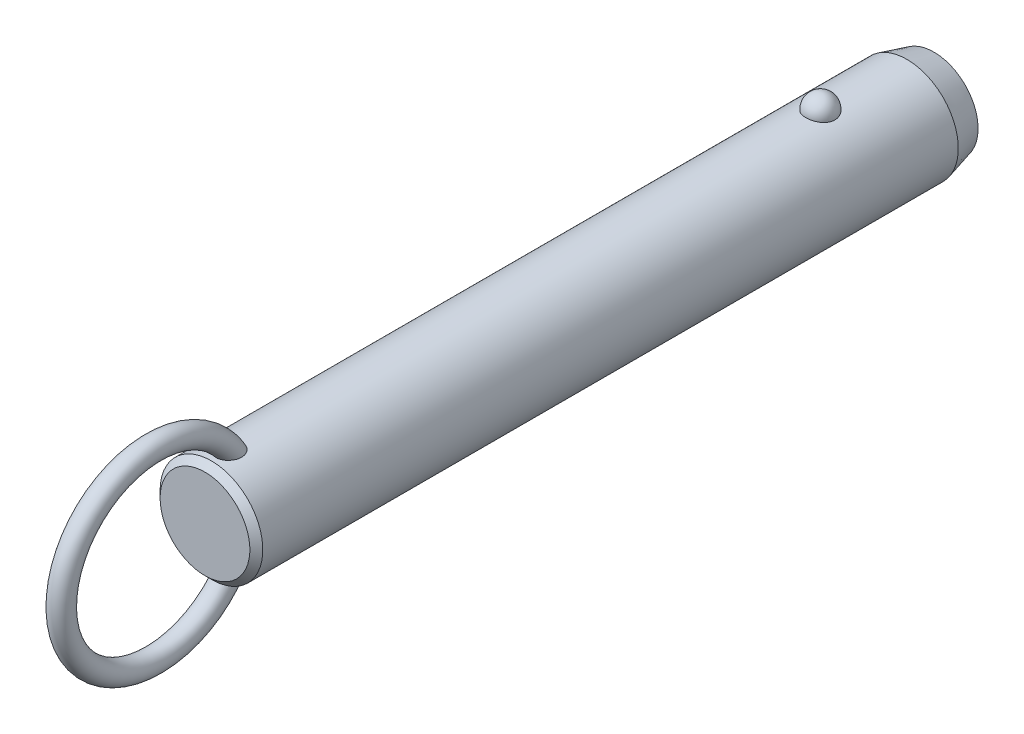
ISO-10303-21;
HEADER;
FILE_DESCRIPTION(('STEP AP214'),'2;1');
FILE_NAME('part.step','',(''),(''),'','','');
FILE_SCHEMA(('AUTOMOTIVE_DESIGN { 1 0 10303 214 1 1 1 1 }'));
ENDSEC;
DATA;
#1=APPLICATION_CONTEXT('core data for automotive mechanical design processes');
#2=APPLICATION_PROTOCOL_DEFINITION('international standard','automotive_design',2000,#1);
#3=PRODUCT_CONTEXT('',#1,'mechanical');
#4=PRODUCT('Part','Part','',(#3));
#5=PRODUCT_RELATED_PRODUCT_CATEGORY('part','',(#4));
#6=PRODUCT_DEFINITION_FORMATION('','',#4);
#7=PRODUCT_DEFINITION_CONTEXT('part definition',#1,'design');
#8=PRODUCT_DEFINITION('design','',#6,#7);
#9=PRODUCT_DEFINITION_SHAPE('','',#8);
#10=(LENGTH_UNIT() NAMED_UNIT(*) SI_UNIT(.MILLI.,.METRE.));
#11=(NAMED_UNIT(*) PLANE_ANGLE_UNIT() SI_UNIT($,.RADIAN.));
#12=(NAMED_UNIT(*) SI_UNIT($,.STERADIAN.) SOLID_ANGLE_UNIT());
#13=UNCERTAINTY_MEASURE_WITH_UNIT(LENGTH_MEASURE(1.E-05),#10,'distance_accuracy_value','');
#14=(GEOMETRIC_REPRESENTATION_CONTEXT(3) GLOBAL_UNCERTAINTY_ASSIGNED_CONTEXT((#13)) GLOBAL_UNIT_ASSIGNED_CONTEXT((#10,
#11,#12)) REPRESENTATION_CONTEXT('',''));
#15=CARTESIAN_POINT('',(0.,0.,0.));
#16=DIRECTION('',(0.,0.,1.));
#17=DIRECTION('',(1.,0.,0.));
#18=AXIS2_PLACEMENT_3D('',#15,#16,#17);
#19=CARTESIAN_POINT('',(0.,0.,101.6));
#20=DIRECTION('',(0.,0.,-1.));
#21=DIRECTION('',(-1.,0.,0.));
#22=AXIS2_PLACEMENT_3D('',#19,#20,#21);
#23=CYLINDRICAL_SURFACE('',#22,9.5);
#24=CARTESIAN_POINT('',(2.67259918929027,9.11631578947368,-2.70000000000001));
#25=CARTESIAN_POINT('',(2.6725968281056,9.11631786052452,-2.54909854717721));
#26=CARTESIAN_POINT('',(2.66030567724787,9.11994722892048,-2.39816735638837));
#27=CARTESIAN_POINT('',(2.6114347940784,9.13405924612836,-2.10058568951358));
#28=CARTESIAN_POINT('',(2.57484658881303,9.14454428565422,-1.95393672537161));
#29=CARTESIAN_POINT('',(2.47830875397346,9.17117631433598,-1.66916069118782));
#30=CARTESIAN_POINT('',(2.41836936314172,9.18732082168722,-1.53102991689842));
#31=CARTESIAN_POINT('',(2.27661331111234,9.22346780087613,-1.26705393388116));
#32=CARTESIAN_POINT('',(2.19479699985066,9.24347021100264,-1.14120852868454));
#33=CARTESIAN_POINT('',(2.01085282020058,9.28522401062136,-0.904632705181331));
#34=CARTESIAN_POINT('',(1.90862396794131,9.30698376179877,-0.793982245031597));
#35=CARTESIAN_POINT('',(1.6867437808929,9.34973971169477,-0.591607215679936));
#36=CARTESIAN_POINT('',(1.56709244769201,9.37073591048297,-0.499882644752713));
#37=CARTESIAN_POINT('',(1.31393976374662,9.40956370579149,-0.338167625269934));
#38=CARTESIAN_POINT('',(1.18048026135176,9.42740444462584,-0.268113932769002));
#39=CARTESIAN_POINT('',(0.903154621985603,9.45799906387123,-0.151390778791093));
#40=CARTESIAN_POINT('',(0.759289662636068,9.47075351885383,-0.104718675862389));
#41=CARTESIAN_POINT('',(0.468074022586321,9.48956256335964,-0.0367633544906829));
#42=CARTESIAN_POINT('',(0.320836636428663,9.49573643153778,-0.0150275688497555));
#43=CARTESIAN_POINT('',(0.0246714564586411,9.50112183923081,0.00396199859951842));
#44=CARTESIAN_POINT('',(-0.124256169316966,9.50033406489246,0.00121819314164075));
#45=CARTESIAN_POINT('',(-0.417264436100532,9.4919475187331,-0.0284441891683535));
#46=CARTESIAN_POINT('',(-0.56138413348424,9.48444885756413,-0.0550074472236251));
#47=CARTESIAN_POINT('',(-0.842986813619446,9.46357853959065,-0.131064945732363));
#48=CARTESIAN_POINT('',(-0.980469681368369,9.450206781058,-0.180559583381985));
#49=CARTESIAN_POINT('',(-1.24585005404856,9.41890822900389,-0.301476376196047));
#50=CARTESIAN_POINT('',(-1.37368611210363,9.40095498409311,-0.373026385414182));
#51=CARTESIAN_POINT('',(-1.61552738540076,9.36242964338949,-0.536025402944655));
#52=CARTESIAN_POINT('',(-1.72953116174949,9.34185727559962,-0.627476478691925));
#53=CARTESIAN_POINT('',(-1.9429225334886,9.29984568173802,-0.829844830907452));
#54=CARTESIAN_POINT('',(-2.04198021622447,9.27839736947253,-0.94110821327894));
#55=CARTESIAN_POINT('',(-2.22026460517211,9.23735994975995,-1.17883414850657));
#56=CARTESIAN_POINT('',(-2.29948985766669,9.21777097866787,-1.30529781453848));
#57=CARTESIAN_POINT('',(-2.43697287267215,9.18238994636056,-1.57158566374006));
#58=CARTESIAN_POINT('',(-2.49497068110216,9.16664569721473,-1.71155057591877));
#59=CARTESIAN_POINT('',(-2.5872073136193,9.14104303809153,-1.99961197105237));
#60=CARTESIAN_POINT('',(-2.62144683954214,9.13118445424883,-2.14770821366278));
#61=CARTESIAN_POINT('',(-2.66521466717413,9.11850622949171,-2.44715424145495));
#62=CARTESIAN_POINT('',(-2.67484831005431,9.11565658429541,-2.59848735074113));
#63=CARTESIAN_POINT('',(-2.66946735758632,9.11723375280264,-2.90067317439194));
#64=CARTESIAN_POINT('',(-2.65445345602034,9.12166036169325,-3.05152590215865));
#65=CARTESIAN_POINT('',(-2.60029711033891,9.13724422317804,-3.34766110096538));
#66=CARTESIAN_POINT('',(-2.56127978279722,9.14836656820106,-3.49296833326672));
#67=CARTESIAN_POINT('',(-2.46018844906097,9.17606676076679,-3.77477535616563));
#68=CARTESIAN_POINT('',(-2.39811349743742,9.1926448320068,-3.9112747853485));
#69=CARTESIAN_POINT('',(-2.25202303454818,9.22952198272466,-4.17244273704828));
#70=CARTESIAN_POINT('',(-2.16788714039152,9.24984129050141,-4.29704106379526));
#71=CARTESIAN_POINT('',(-1.9799408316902,9.29188255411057,-4.53013066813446));
#72=CARTESIAN_POINT('',(-1.87612963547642,9.31360456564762,-4.63862130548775));
#73=CARTESIAN_POINT('',(-1.65105429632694,9.35612959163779,-4.8369029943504));
#74=CARTESIAN_POINT('',(-1.52972405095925,9.37692871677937,-4.92661991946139));
#75=CARTESIAN_POINT('',(-1.27318250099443,9.41518970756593,-5.08429106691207));
#76=CARTESIAN_POINT('',(-1.13797219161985,9.432651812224,-5.15224684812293));
#77=CARTESIAN_POINT('',(-0.859280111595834,9.46208255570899,-5.26371827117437));
#78=CARTESIAN_POINT('',(-0.715925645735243,9.47411833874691,-5.30753421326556));
#79=CARTESIAN_POINT('',(-0.423550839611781,9.4916822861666,-5.37076321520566));
#80=CARTESIAN_POINT('',(-0.2745312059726,9.49721125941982,-5.39017930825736));
#81=CARTESIAN_POINT('',(0.0218446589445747,9.50110860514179,-5.40390587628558));
#82=CARTESIAN_POINT('',(0.16917707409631,9.49961381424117,-5.39869609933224));
#83=CARTESIAN_POINT('',(0.460808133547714,9.48993906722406,-5.36441955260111));
#84=CARTESIAN_POINT('',(0.605106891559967,9.48175936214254,-5.33535367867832));
#85=CARTESIAN_POINT('',(0.886027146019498,9.4596376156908,-5.25435587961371));
#86=CARTESIAN_POINT('',(1.02267710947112,9.44571881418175,-5.20251612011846));
#87=CARTESIAN_POINT('',(1.28523827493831,9.41358993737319,-5.07741549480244));
#88=CARTESIAN_POINT('',(1.41114877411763,9.39537958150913,-5.00415322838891));
#89=CARTESIAN_POINT('',(1.65085227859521,9.3562644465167,-4.83684599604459));
#90=CARTESIAN_POINT('',(1.76442346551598,9.33532178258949,-4.74249218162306));
#91=CARTESIAN_POINT('',(1.97425672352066,9.29321198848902,-4.53620389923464));
#92=CARTESIAN_POINT('',(2.07051582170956,9.27204482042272,-4.42426641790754));
#93=CARTESIAN_POINT('',(2.24490086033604,9.23139221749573,-4.18363183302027));
#94=CARTESIAN_POINT('',(2.32267019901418,9.21194380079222,-4.05466990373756));
#95=CARTESIAN_POINT('',(2.45584092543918,9.1773419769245,-3.78517836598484));
#96=CARTESIAN_POINT('',(2.5112497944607,9.16218713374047,-3.64465264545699));
#97=CARTESIAN_POINT('',(2.59380876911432,9.13913522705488,-3.37104301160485));
#98=CARTESIAN_POINT('',(2.62330266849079,9.13064624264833,-3.23871053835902));
#99=CARTESIAN_POINT('',(2.66269870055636,9.11923566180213,-2.97092664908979));
#100=CARTESIAN_POINT('',(2.67260130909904,9.11631393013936,-2.83547530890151));
#101=CARTESIAN_POINT('',(2.67259918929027,9.11631578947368,-2.70000000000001));
#102=B_SPLINE_CURVE_WITH_KNOTS('',3,(#24,#25,#26,#27,#28,#29,#30,#31,#32,#33,#34,#35,#36,#37,
#38,#39,#40,#41,#42,#43,#44,#45,#46,#47,#48,#49,#50,#51,#52,#53,#54,#55,#56,#57,#58,#59,#60,#61,
#62,#63,#64,#65,#66,#67,#68,#69,#70,#71,#72,#73,#74,#75,#76,#77,#78,#79,#80,#81,#82,#83,#84,#85,
#86,#87,#88,#89,#90,#91,#92,#93,#94,#95,#96,#97,#98,#99,#100,#101),.UNSPECIFIED.,.T.,.F.,(4,2,2,
2,2,2,2,2,2,2,2,2,2,2,2,2,2,2,2,2,2,2,2,2,2,2,2,2,2,2,2,2,2,2,2,2,2,2,4),(0.,0.452217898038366,
0.904593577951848,1.35677112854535,1.80894144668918,2.26340676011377,2.71787203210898,
3.17099820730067,3.62407318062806,4.0687883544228,4.51345969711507,4.95160616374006,
5.38976021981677,5.83050358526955,6.27129275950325,6.72071308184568,7.17016633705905,
7.62495278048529,8.07972578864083,8.53254856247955,8.98535859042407,9.43582813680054,
9.88631615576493,10.3393155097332,10.7923328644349,11.2471065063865,11.7018475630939,
12.150795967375,12.599688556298,13.0398725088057,13.4800399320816,13.9184421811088,
14.3568730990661,14.802202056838,15.2476074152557,15.7010097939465,16.1542603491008,
16.5602594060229,16.966248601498),.UNSPECIFIED.);
#103=CARTESIAN_POINT('',(2.67259918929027,9.11631578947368,-2.70000000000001));
#104=VERTEX_POINT('',#103);
#105=EDGE_CURVE('E41',#104,#104,#102,.T.);
#106=ORIENTED_EDGE('',*,*,#105,.T.);
#107=EDGE_LOOP('',(#106));
#108=FACE_BOUND('',#107,.T.);
#109=CARTESIAN_POINT('',(0.,0.,109.92));
#110=DIRECTION('',(0.,0.,1.));
#111=DIRECTION('',(1.,0.,0.));
#112=AXIS2_PLACEMENT_3D('',#109,#110,#111);
#113=CIRCLE('',#112,9.5);
#114=CARTESIAN_POINT('',(-9.50000000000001,0.,109.92));
#115=VERTEX_POINT('',#114);
#116=EDGE_CURVE('E10',#115,#115,#113,.F.);
#117=ORIENTED_EDGE('',*,*,#116,.T.);
#118=EDGE_LOOP('',(#117));
#119=FACE_BOUND('',#118,.T.);
#120=CARTESIAN_POINT('',(-0.697062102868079,-9.47439269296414,104.267808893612));
#121=CARTESIAN_POINT('',(-0.799579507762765,-9.46685146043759,104.307482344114));
#122=CARTESIAN_POINT('',(-0.898575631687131,-9.45788043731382,104.3559309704));
#123=CARTESIAN_POINT('',(-1.08670047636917,-9.43811593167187,104.468868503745));
#124=CARTESIAN_POINT('',(-1.17583204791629,-9.42732297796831,104.533352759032));
#125=CARTESIAN_POINT('',(-1.34179806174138,-9.40513672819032,104.676209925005));
#126=CARTESIAN_POINT('',(-1.41865133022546,-9.39374438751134,104.754561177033));
#127=CARTESIAN_POINT('',(-1.5586004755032,-9.37154196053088,104.922752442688));
#128=CARTESIAN_POINT('',(-1.62169476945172,-9.3607319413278,105.01259377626));
#129=CARTESIAN_POINT('',(-1.73527695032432,-9.34035749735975,105.204500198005));
#130=CARTESIAN_POINT('',(-1.7852226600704,-9.33085270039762,105.306891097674));
#131=CARTESIAN_POINT('',(-1.86924997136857,-9.3143834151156,105.518148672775));
#132=CARTESIAN_POINT('',(-1.90332570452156,-9.30741986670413,105.627017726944));
#133=CARTESIAN_POINT('',(-1.95893603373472,-9.29588482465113,105.860473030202));
#134=CARTESIAN_POINT('',(-1.97872420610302,-9.29165182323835,105.985489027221));
#135=CARTESIAN_POINT('',(-2.00062129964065,-9.28695978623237,106.237080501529));
#136=CARTESIAN_POINT('',(-2.00272284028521,-9.28650232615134,106.363656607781));
#137=CARTESIAN_POINT('',(-1.98958876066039,-9.28932750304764,106.636815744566));
#138=CARTESIAN_POINT('',(-1.97143366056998,-9.2932400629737,106.783251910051));
#139=CARTESIAN_POINT('',(-1.91479925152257,-9.30507151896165,107.072062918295));
#140=CARTESIAN_POINT('',(-1.87629122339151,-9.31299607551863,107.214431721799));
#141=CARTESIAN_POINT('',(-1.77225683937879,-9.33340232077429,107.515172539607));
#142=CARTESIAN_POINT('',(-1.70334898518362,-9.34641636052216,107.672369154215));
#143=CARTESIAN_POINT('',(-1.58111062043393,-9.36759153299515,107.897517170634));
#144=CARTESIAN_POINT('',(-1.53721459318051,-9.37492619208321,107.970796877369));
#145=CARTESIAN_POINT('',(-1.44302631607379,-9.38988566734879,108.11307405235));
#146=CARTESIAN_POINT('',(-1.39273721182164,-9.39751033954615,108.182073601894));
#147=CARTESIAN_POINT('',(-1.26775962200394,-9.41530678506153,108.336983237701));
#148=CARTESIAN_POINT('',(-1.19052326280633,-9.42548108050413,108.420871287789));
#149=CARTESIAN_POINT('',(-1.02420241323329,-9.44499825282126,108.576008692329));
#150=CARTESIAN_POINT('',(-0.935139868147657,-9.45434261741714,108.647280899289));
#151=CARTESIAN_POINT('',(-0.766610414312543,-9.46930670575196,108.758695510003));
#152=CARTESIAN_POINT('',(-0.689439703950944,-9.47529223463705,108.802235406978));
#153=CARTESIAN_POINT('',(-0.528942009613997,-9.48560294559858,108.87631336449));
#154=CARTESIAN_POINT('',(-0.445620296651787,-9.48992953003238,108.906862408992));
#155=CARTESIAN_POINT('',(-0.273901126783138,-9.49644161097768,108.952579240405));
#156=CARTESIAN_POINT('',(-0.185465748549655,-9.49860811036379,108.96761059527));
#157=CARTESIAN_POINT('',(-0.00734541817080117,-9.5004135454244,108.980149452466));
#158=CARTESIAN_POINT('',(0.0823387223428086,-9.50005405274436,108.977667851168));
#159=CARTESIAN_POINT('',(0.247679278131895,-9.49708301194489,108.956995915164));
#160=CARTESIAN_POINT('',(0.323620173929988,-9.49477609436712,108.940930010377));
#161=CARTESIAN_POINT('',(0.471981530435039,-9.48855917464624,108.897172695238));
#162=CARTESIAN_POINT('',(0.544400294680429,-9.48464840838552,108.869475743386));
#163=CARTESIAN_POINT('',(0.70894789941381,-9.47398336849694,108.79280266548));
#164=CARTESIAN_POINT('',(0.799149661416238,-9.46671310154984,108.739774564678));
#165=CARTESIAN_POINT('',(0.969783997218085,-9.45076225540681,108.619973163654));
#166=CARTESIAN_POINT('',(1.05019415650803,-9.44207854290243,108.553169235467));
#167=CARTESIAN_POINT('',(1.23092343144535,-9.42051459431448,108.380759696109));
#168=CARTESIAN_POINT('',(1.3265249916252,-9.40733378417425,108.27026193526));
#169=CARTESIAN_POINT('',(1.49893121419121,-9.38140745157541,108.035561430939));
#170=CARTESIAN_POINT('',(1.57571616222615,-9.36866239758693,107.911344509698));
#171=CARTESIAN_POINT('',(1.71285426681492,-9.34457644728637,107.649389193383));
#172=CARTESIAN_POINT('',(1.77266365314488,-9.33328726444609,107.51136233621));
#173=CARTESIAN_POINT('',(1.87239208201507,-9.31379209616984,107.228051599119));
#174=CARTESIAN_POINT('',(1.9123015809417,-9.3055875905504,107.082764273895));
#175=CARTESIAN_POINT('',(1.97604189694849,-9.29228394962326,106.762028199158));
#176=CARTESIAN_POINT('',(1.99587438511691,-9.28797202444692,106.585724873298));
#177=CARTESIAN_POINT('',(2.0029570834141,-9.28645519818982,106.232414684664));
#178=CARTESIAN_POINT('',(1.99025930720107,-9.28923895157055,106.055409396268));
#179=CARTESIAN_POINT('',(1.93735479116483,-9.30038134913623,105.756338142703));
#180=CARTESIAN_POINT('',(1.90576827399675,-9.30697680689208,105.632667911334));
#181=CARTESIAN_POINT('',(1.82287484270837,-9.32356855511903,105.392329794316));
#182=CARTESIAN_POINT('',(1.77158213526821,-9.33356239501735,105.275656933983));
#183=CARTESIAN_POINT('',(1.64885744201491,-9.35602275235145,105.052706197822));
#184=CARTESIAN_POINT('',(1.57730995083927,-9.36850332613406,104.946492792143));
#185=CARTESIAN_POINT('',(1.4154326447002,-9.39431873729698,104.749553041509));
#186=CARTESIAN_POINT('',(1.32510883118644,-9.40765330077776,104.658821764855));
#187=CARTESIAN_POINT('',(1.13846223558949,-9.43195720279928,104.505033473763));
#188=CARTESIAN_POINT('',(1.04369890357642,-9.44302894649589,104.440094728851));
#189=CARTESIAN_POINT('',(0.843965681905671,-9.46296805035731,104.328038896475));
#190=CARTESIAN_POINT('',(0.739000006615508,-9.47183631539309,104.280914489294));
#191=CARTESIAN_POINT('',(0.528175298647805,-9.48586140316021,104.208117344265));
#192=CARTESIAN_POINT('',(0.422686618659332,-9.49119633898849,104.18140249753));
#193=CARTESIAN_POINT('',(0.208590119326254,-9.49831365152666,104.146013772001));
#194=CARTESIAN_POINT('',(0.0999817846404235,-9.500095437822,104.137342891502));
#195=CARTESIAN_POINT('',(-0.126104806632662,-9.49988861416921,104.138350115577));
#196=CARTESIAN_POINT('',(-0.24357872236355,-9.49757821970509,104.149594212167));
#197=CARTESIAN_POINT('',(-0.474390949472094,-9.48885165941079,104.193167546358));
#198=CARTESIAN_POINT('',(-0.587729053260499,-9.48243528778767,104.225497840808));
#199=CARTESIAN_POINT('',(-0.697062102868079,-9.47439269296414,104.267808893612));
#200=B_SPLINE_CURVE_WITH_KNOTS('',3,(#120,#121,#122,#123,#124,#125,#126,#127,#128,#129,#130,
#131,#132,#133,#134,#135,#136,#137,#138,#139,#140,#141,#142,#143,#144,#145,#146,#147,#148,#149,
#150,#151,#152,#153,#154,#155,#156,#157,#158,#159,#160,#161,#162,#163,#164,#165,#166,#167,#168,
#169,#170,#171,#172,#173,#174,#175,#176,#177,#178,#179,#180,#181,#182,#183,#184,#185,#186,#187,
#188,#189,#190,#191,#192,#193,#194,#195,#196,#197,#198,#199),.UNSPECIFIED.,.T.,.F.,(4,2,2,2,2,2,
2,2,2,2,2,2,2,2,2,2,2,2,2,2,2,2,2,2,2,2,2,2,2,2,2,2,2,2,2,2,2,2,2,4),(0.,0.330119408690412,
0.660143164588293,0.989655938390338,1.31920659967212,1.66074728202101,2.00241415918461,
2.38088696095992,2.7595176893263,3.20065679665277,3.6424200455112,4.15620996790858,
4.4131416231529,4.66994734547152,5.01228664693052,5.35399933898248,5.61943037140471,
5.88463652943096,6.15215502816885,6.41950709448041,6.65144391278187,6.88349136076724,
7.19641200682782,7.51003602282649,7.94779711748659,8.38601491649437,8.83699707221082,
9.28819530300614,9.81778662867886,10.3465317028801,10.7284172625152,11.110028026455,
11.4938603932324,11.8775702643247,12.2220189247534,12.5663259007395,12.8915939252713,
13.2169159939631,13.5689650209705,13.9210316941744),.UNSPECIFIED.);
#201=CARTESIAN_POINT('',(-0.697062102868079,-9.47439269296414,104.267808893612));
#202=VERTEX_POINT('',#201);
#203=EDGE_CURVE('E59',#202,#202,#200,.T.);
#204=ORIENTED_EDGE('',*,*,#203,.T.);
#205=EDGE_LOOP('',(#204));
#206=FACE_BOUND('',#205,.T.);
#207=CARTESIAN_POINT('',(-0.697062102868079,9.47439269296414,104.267808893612));
#208=CARTESIAN_POINT('',(-0.59779262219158,9.48169483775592,104.22939564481));
#209=CARTESIAN_POINT('',(-0.495106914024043,9.48766580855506,104.199168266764));
#210=CARTESIAN_POINT('',(-0.285876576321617,9.49627648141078,104.156032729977));
#211=CARTESIAN_POINT('',(-0.179324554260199,9.49890941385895,104.143159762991));
#212=CARTESIAN_POINT('',(0.0344157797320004,9.50053798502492,104.135166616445));
#213=CARTESIAN_POINT('',(0.141603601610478,9.49953613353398,104.140034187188));
#214=CARTESIAN_POINT('',(0.353563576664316,9.49401038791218,104.167365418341));
#215=CARTESIAN_POINT('',(0.458336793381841,9.48948807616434,104.18982117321));
#216=CARTESIAN_POINT('',(0.662493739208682,9.4774236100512,104.251671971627));
#217=CARTESIAN_POINT('',(0.761881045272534,9.46988348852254,104.291055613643));
#218=CARTESIAN_POINT('',(0.952608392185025,9.45260382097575,104.385634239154));
#219=CARTESIAN_POINT('',(1.04394806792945,9.44286417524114,104.440829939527));
#220=CARTESIAN_POINT('',(1.21712767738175,9.42211760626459,104.566066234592));
#221=CARTESIAN_POINT('',(1.29885671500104,9.41109835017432,104.636257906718));
#222=CARTESIAN_POINT('',(1.44978975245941,9.38903310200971,104.788980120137));
#223=CARTESIAN_POINT('',(1.51899278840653,9.37798710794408,104.871511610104));
#224=CARTESIAN_POINT('',(1.64602857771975,9.35654375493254,105.049776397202));
#225=CARTESIAN_POINT('',(1.70333052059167,9.34618688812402,105.145891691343));
#226=CARTESIAN_POINT('',(1.80259341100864,9.32755128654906,105.345897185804));
#227=CARTESIAN_POINT('',(1.84454942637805,9.31927322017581,105.449789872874));
#228=CARTESIAN_POINT('',(1.91637039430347,9.30478365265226,105.672213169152));
#229=CARTESIAN_POINT('',(1.944805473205,9.29882552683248,105.791219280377));
#230=CARTESIAN_POINT('',(1.98449865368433,9.29043398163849,106.032143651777));
#231=CARTESIAN_POINT('',(1.99574908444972,9.28800213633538,106.154063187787));
#232=CARTESIAN_POINT('',(2.00275141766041,9.28649645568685,106.416932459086));
#233=CARTESIAN_POINT('',(1.99588238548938,9.28799035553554,106.557952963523));
#234=CARTESIAN_POINT('',(1.96270559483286,9.29505517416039,106.837621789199));
#235=CARTESIAN_POINT('',(1.93637872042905,9.30063010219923,106.976267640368));
#236=CARTESIAN_POINT('',(1.85949176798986,9.31633564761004,107.272561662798));
#237=CARTESIAN_POINT('',(1.80549792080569,9.3270926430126,107.429290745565));
#238=CARTESIAN_POINT('',(1.67376869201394,9.3516306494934,107.732284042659));
#239=CARTESIAN_POINT('',(1.59603181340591,9.36541185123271,107.878547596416));
#240=CARTESIAN_POINT('',(1.4360277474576,9.39110706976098,108.125813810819));
#241=CARTESIAN_POINT('',(1.35831795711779,9.40278656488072,108.229791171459));
#242=CARTESIAN_POINT('',(1.18774483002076,9.42585025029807,108.424534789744));
#243=CARTESIAN_POINT('',(1.09490932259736,9.43723493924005,108.515324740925));
#244=CARTESIAN_POINT('',(0.921110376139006,9.45552616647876,108.65620334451));
#245=CARTESIAN_POINT('',(0.843738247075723,9.46281058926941,108.710656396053));
#246=CARTESIAN_POINT('',(0.681245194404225,9.47589120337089,108.806711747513));
#247=CARTESIAN_POINT('',(0.596135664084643,9.48168953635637,108.848332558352));
#248=CARTESIAN_POINT('',(0.433779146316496,9.49038144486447,108.910089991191));
#249=CARTESIAN_POINT('',(0.357459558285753,9.49359170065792,108.93260136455));
#250=CARTESIAN_POINT('',(0.202074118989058,9.49816761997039,108.964574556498));
#251=CARTESIAN_POINT('',(0.123010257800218,9.49953459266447,108.974045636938));
#252=CARTESIAN_POINT('',(-0.0357372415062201,9.50026497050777,108.979114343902));
#253=CARTESIAN_POINT('',(-0.115421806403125,9.49962433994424,108.974684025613));
#254=CARTESIAN_POINT('',(-0.272823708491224,9.49640854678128,108.952296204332));
#255=CARTESIAN_POINT('',(-0.350540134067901,9.4938325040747,108.934332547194));
#256=CARTESIAN_POINT('',(-0.500580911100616,9.4870946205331,108.886802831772));
#257=CARTESIAN_POINT('',(-0.57297929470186,9.48296359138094,108.857461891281));
#258=CARTESIAN_POINT('',(-0.712864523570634,9.47347609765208,108.789008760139));
#259=CARTESIAN_POINT('',(-0.780349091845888,9.46811906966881,108.749892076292));
#260=CARTESIAN_POINT('',(-0.94630921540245,9.45329720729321,108.639432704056));
#261=CARTESIAN_POINT('',(-1.04090230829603,9.44321512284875,108.562329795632));
#262=CARTESIAN_POINT('',(-1.21661929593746,9.42219227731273,108.39409718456));
#263=CARTESIAN_POINT('',(-1.2977051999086,9.41124921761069,108.302929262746));
#264=CARTESIAN_POINT('',(-1.47319646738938,9.38563439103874,108.076162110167));
#265=CARTESIAN_POINT('',(-1.56208878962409,9.37102009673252,107.936289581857));
#266=CARTESIAN_POINT('',(-1.71623987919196,9.34401559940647,107.643950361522));
#267=CARTESIAN_POINT('',(-1.78147866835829,9.33162728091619,107.491473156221));
#268=CARTESIAN_POINT('',(-1.88853837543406,9.31055541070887,107.175647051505));
#269=CARTESIAN_POINT('',(-1.92998995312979,9.30193076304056,107.012168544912));
#270=CARTESIAN_POINT('',(-1.98590726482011,9.29015757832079,106.680526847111));
#271=CARTESIAN_POINT('',(-2.0004070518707,9.2870021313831,106.512369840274));
#272=CARTESIAN_POINT('',(-1.99964701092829,9.28716218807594,106.205080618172));
#273=CARTESIAN_POINT('',(-1.98908145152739,9.28945704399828,106.065936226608));
#274=CARTESIAN_POINT('',(-1.94566294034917,9.29865169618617,105.791153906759));
#275=CARTESIAN_POINT('',(-1.91282062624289,9.30554929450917,105.655514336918));
#276=CARTESIAN_POINT('',(-1.84582133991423,9.31898248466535,105.457802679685));
#277=CARTESIAN_POINT('',(-1.82038084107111,9.32400364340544,105.392583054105));
#278=CARTESIAN_POINT('',(-1.76350511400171,9.33492884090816,105.264903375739));
#279=CARTESIAN_POINT('',(-1.73207305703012,9.34083241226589,105.202441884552));
#280=CARTESIAN_POINT('',(-1.6632424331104,9.353333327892,105.08094078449));
#281=CARTESIAN_POINT('',(-1.62584239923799,9.35993084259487,105.021902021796));
#282=CARTESIAN_POINT('',(-1.54527678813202,9.37356864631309,104.907987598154));
#283=CARTESIAN_POINT('',(-1.50211241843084,9.38060884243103,104.853111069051));
#284=CARTESIAN_POINT('',(-1.37681147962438,9.40004442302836,104.709961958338));
#285=CARTESIAN_POINT('',(-1.28916358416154,9.41261047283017,104.626429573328));
#286=CARTESIAN_POINT('',(-1.09996826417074,9.43658180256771,104.477236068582));
#287=CARTESIAN_POINT('',(-0.998461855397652,9.44799034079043,104.411523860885));
#288=CARTESIAN_POINT('',(-0.860188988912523,9.46103017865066,104.3394367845));
#289=CARTESIAN_POINT('',(-0.828141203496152,9.46389141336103,104.323851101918));
#290=CARTESIAN_POINT('',(-0.763210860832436,9.46934915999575,104.294473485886));
#291=CARTESIAN_POINT('',(-0.730328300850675,9.47194567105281,104.280681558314));
#292=CARTESIAN_POINT('',(-0.697062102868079,9.47439269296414,104.267808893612));
#293=B_SPLINE_CURVE_WITH_KNOTS('',3,(#207,#208,#209,#210,#211,#212,#213,#214,#215,#216,#217,
#218,#219,#220,#221,#222,#223,#224,#225,#226,#227,#228,#229,#230,#231,#232,#233,#234,#235,#236,
#237,#238,#239,#240,#241,#242,#243,#244,#245,#246,#247,#248,#249,#250,#251,#252,#253,#254,#255,
#256,#257,#258,#259,#260,#261,#262,#263,#264,#265,#266,#267,#268,#269,#270,#271,#272,#273,#274,
#275,#276,#277,#278,#279,#280,#281,#282,#283,#284,#285,#286,#287,#288,#289,#290,#291,#292),
.UNSPECIFIED.,.T.,.F.,(4,2,2,2,2,2,2,2,2,2,2,2,2,2,2,2,2,2,2,2,2,2,2,2,2,2,2,2,2,2,2,2,2,2,2,2,
2,2,2,2,2,2,4),(0.,0.319942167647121,0.640532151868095,0.960900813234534,1.28112555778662,
1.60113495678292,1.92115886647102,2.24457323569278,2.56801248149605,2.90371927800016,
3.23953387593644,3.60560313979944,3.97183576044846,4.39383693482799,4.81625324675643,
5.31257045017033,5.80891895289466,6.19868344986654,6.58773876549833,6.87145417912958,
7.15475838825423,7.3926375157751,7.63034760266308,7.86853584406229,8.10683246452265,
8.3406366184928,8.57454843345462,8.93983939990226,9.30614105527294,9.8026666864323,
10.2996107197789,10.8040753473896,11.3079021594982,11.7249776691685,12.1418541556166,
12.3521485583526,12.562331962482,12.7725671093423,12.9827582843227,13.345827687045,
13.7078449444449,13.8150604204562,13.9222762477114),.UNSPECIFIED.);
#294=CARTESIAN_POINT('',(-0.697062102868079,9.47439269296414,104.267808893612));
#295=VERTEX_POINT('',#294);
#296=EDGE_CURVE('E67',#295,#295,#293,.T.);
#297=ORIENTED_EDGE('',*,*,#296,.T.);
#298=EDGE_LOOP('',(#297));
#299=FACE_BOUND('',#298,.T.);
#300=CARTESIAN_POINT('',(0.,0.,-18.6999999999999));
#301=DIRECTION('',(0.,0.,-1.));
#302=DIRECTION('',(-1.,0.,0.));
#303=AXIS2_PLACEMENT_3D('',#300,#301,#302);
#304=CIRCLE('',#303,9.5);
#305=CARTESIAN_POINT('',(-9.5,0.,-18.6999999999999));
#306=VERTEX_POINT('',#305);
#307=EDGE_CURVE('E56',#306,#306,#304,.F.);
#308=ORIENTED_EDGE('',*,*,#307,.T.);
#309=EDGE_LOOP('',(#308));
#310=FACE_BOUND('',#309,.T.);
#311=ADVANCED_FACE('F37',(#108,#119,#206,#299,#310),#23,.T.);
#312=CARTESIAN_POINT('',(0.,0.,-23.7));
#313=DIRECTION('',(0.,0.,-1.));
#314=DIRECTION('',(-1.,0.,0.));
#315=AXIS2_PLACEMENT_3D('',#312,#313,#314);
#316=PLANE('',#315);
#317=CARTESIAN_POINT('',(0.,0.,-23.7));
#318=DIRECTION('',(0.,0.,-1.));
#319=DIRECTION('',(-1.,0.,0.));
#320=AXIS2_PLACEMENT_3D('',#317,#318,#319);
#321=CIRCLE('',#320,8.16025403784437);
#322=CARTESIAN_POINT('',(-8.16025403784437,0.,-23.7));
#323=VERTEX_POINT('',#322);
#324=EDGE_CURVE('E66',#323,#323,#321,.T.);
#325=ORIENTED_EDGE('',*,*,#324,.T.);
#326=EDGE_LOOP('',(#325));
#327=FACE_BOUND('',#326,.T.);
#328=ADVANCED_FACE('F85',(#327),#316,.T.);
#329=CARTESIAN_POINT('',(0.,0.,-23.7));
#330=DIRECTION('',(0.,0.,1.));
#331=DIRECTION('',(1.,0.,0.));
#332=AXIS2_PLACEMENT_3D('',#329,#330,#331);
#333=CONICAL_SURFACE('',#332,8.16025403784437,0.261799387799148);
#334=ORIENTED_EDGE('',*,*,#307,.F.);
#335=EDGE_LOOP('',(#334));
#336=FACE_BOUND('',#335,.T.);
#337=ORIENTED_EDGE('',*,*,#324,.F.);
#338=EDGE_LOOP('',(#337));
#339=FACE_BOUND('',#338,.T.);
#340=ADVANCED_FACE('F83',(#336,#339),#333,.T.);
#341=CARTESIAN_POINT('',(0.,0.,111.12));
#342=DIRECTION('',(0.,0.,1.));
#343=DIRECTION('',(1.,0.,0.));
#344=AXIS2_PLACEMENT_3D('',#341,#342,#343);
#345=PLANE('',#344);
#346=CARTESIAN_POINT('',(0.,0.,111.12));
#347=DIRECTION('',(0.,0.,1.));
#348=DIRECTION('',(1.,0.,0.));
#349=AXIS2_PLACEMENT_3D('',#346,#347,#348);
#350=CIRCLE('',#349,8.29999999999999);
#351=CARTESIAN_POINT('',(-8.3,0.,111.12));
#352=VERTEX_POINT('',#351);
#353=EDGE_CURVE('E50',#352,#352,#350,.T.);
#354=ORIENTED_EDGE('',*,*,#353,.T.);
#355=EDGE_LOOP('',(#354));
#356=FACE_BOUND('',#355,.T.);
#357=ADVANCED_FACE('F77',(#356),#345,.T.);
#358=CARTESIAN_POINT('',(0.,0.,120.65));
#359=DIRECTION('',(1.,0.,0.));
#360=DIRECTION('',(0.,0.,-1.));
#361=AXIS2_PLACEMENT_3D('',#358,#359,#360);
#362=TOROIDAL_SURFACE('',#361,17.05,2.);
#363=ORIENTED_EDGE('',*,*,#296,.F.);
#364=EDGE_LOOP('',(#363));
#365=FACE_BOUND('',#364,.T.);
#366=ORIENTED_EDGE('',*,*,#203,.F.);
#367=EDGE_LOOP('',(#366));
#368=FACE_BOUND('',#367,.T.);
#369=ADVANCED_FACE('F73',(#365,#368),#362,.T.);
#370=CARTESIAN_POINT('',(0.,0.,111.12));
#371=DIRECTION('',(0.,0.,-1.));
#372=DIRECTION('',(-1.,0.,0.));
#373=AXIS2_PLACEMENT_3D('',#370,#371,#372);
#374=CONICAL_SURFACE('',#373,8.29999999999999,0.785398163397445);
#375=CARTESIAN_POINT('',(-9.50000000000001,0.,109.92));
#376=CARTESIAN_POINT('',(-9.48750000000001,0.,109.9325));
#377=CARTESIAN_POINT('',(-9.47500000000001,0.,109.945));
#378=CARTESIAN_POINT('',(-9.45,0.,109.97));
#379=CARTESIAN_POINT('',(-9.43750000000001,0.,109.9825));
#380=CARTESIAN_POINT('',(-9.41250000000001,0.,110.0075));
#381=CARTESIAN_POINT('',(-9.40000000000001,0.,110.02));
#382=CARTESIAN_POINT('',(-9.37500000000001,0.,110.045));
#383=CARTESIAN_POINT('',(-9.36250000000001,0.,110.0575));
#384=CARTESIAN_POINT('',(-9.33750000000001,0.,110.0825));
#385=CARTESIAN_POINT('',(-9.325,0.,110.095));
#386=CARTESIAN_POINT('',(-9.3,0.,110.12));
#387=CARTESIAN_POINT('',(-9.2875,0.,110.1325));
#388=CARTESIAN_POINT('',(-9.2625,0.,110.1575));
#389=CARTESIAN_POINT('',(-9.25000000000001,0.,110.17));
#390=CARTESIAN_POINT('',(-9.225,0.,110.195));
#391=CARTESIAN_POINT('',(-9.2125,0.,110.2075));
#392=CARTESIAN_POINT('',(-9.1875,0.,110.2325));
#393=CARTESIAN_POINT('',(-9.175,0.,110.245));
#394=CARTESIAN_POINT('',(-9.15000000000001,0.,110.27));
#395=CARTESIAN_POINT('',(-9.1375,0.,110.2825));
#396=CARTESIAN_POINT('',(-9.1125,0.,110.3075));
#397=CARTESIAN_POINT('',(-9.1,0.,110.32));
#398=CARTESIAN_POINT('',(-9.075,0.,110.345));
#399=CARTESIAN_POINT('',(-9.0625,0.,110.3575));
#400=CARTESIAN_POINT('',(-9.0375,0.,110.3825));
#401=CARTESIAN_POINT('',(-9.025,0.,110.395));
#402=CARTESIAN_POINT('',(-9.,0.,110.42));
#403=CARTESIAN_POINT('',(-8.9875,0.,110.4325));
#404=CARTESIAN_POINT('',(-8.9625,0.,110.4575));
#405=CARTESIAN_POINT('',(-8.95,0.,110.47));
#406=CARTESIAN_POINT('',(-8.925,0.,110.495));
#407=CARTESIAN_POINT('',(-8.9125,0.,110.5075));
#408=CARTESIAN_POINT('',(-8.8875,0.,110.5325));
#409=CARTESIAN_POINT('',(-8.875,0.,110.545));
#410=CARTESIAN_POINT('',(-8.85,0.,110.57));
#411=CARTESIAN_POINT('',(-8.8375,0.,110.5825));
#412=CARTESIAN_POINT('',(-8.8125,0.,110.6075));
#413=CARTESIAN_POINT('',(-8.8,0.,110.62));
#414=CARTESIAN_POINT('',(-8.775,0.,110.645));
#415=CARTESIAN_POINT('',(-8.7625,0.,110.6575));
#416=CARTESIAN_POINT('',(-8.7375,0.,110.6825));
#417=CARTESIAN_POINT('',(-8.725,0.,110.695));
#418=CARTESIAN_POINT('',(-8.7,0.,110.72));
#419=CARTESIAN_POINT('',(-8.6875,0.,110.7325));
#420=CARTESIAN_POINT('',(-8.6625,0.,110.7575));
#421=CARTESIAN_POINT('',(-8.65,0.,110.77));
#422=CARTESIAN_POINT('',(-8.625,0.,110.795));
#423=CARTESIAN_POINT('',(-8.6125,0.,110.8075));
#424=CARTESIAN_POINT('',(-8.5875,0.,110.8325));
#425=CARTESIAN_POINT('',(-8.575,0.,110.845));
#426=CARTESIAN_POINT('',(-8.55,0.,110.87));
#427=CARTESIAN_POINT('',(-8.5375,0.,110.8825));
#428=CARTESIAN_POINT('',(-8.5125,0.,110.9075));
#429=CARTESIAN_POINT('',(-8.5,0.,110.92));
#430=CARTESIAN_POINT('',(-8.475,0.,110.945));
#431=CARTESIAN_POINT('',(-8.4625,0.,110.9575));
#432=CARTESIAN_POINT('',(-8.43749999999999,0.,110.9825));
#433=CARTESIAN_POINT('',(-8.425,0.,110.995));
#434=CARTESIAN_POINT('',(-8.4,0.,111.02));
#435=CARTESIAN_POINT('',(-8.3875,0.,111.0325));
#436=CARTESIAN_POINT('',(-8.3625,0.,111.0575));
#437=CARTESIAN_POINT('',(-8.35,0.,111.07));
#438=CARTESIAN_POINT('',(-8.32499999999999,0.,111.095));
#439=CARTESIAN_POINT('',(-8.31249999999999,0.,111.1075));
#440=CARTESIAN_POINT('',(-8.3,0.,111.12));
#441=B_SPLINE_CURVE_WITH_KNOTS('',3,(#375,#376,#377,#378,#379,#380,#381,#382,#383,#384,#385,
#386,#387,#388,#389,#390,#391,#392,#393,#394,#395,#396,#397,#398,#399,#400,#401,#402,#403,#404,
#405,#406,#407,#408,#409,#410,#411,#412,#413,#414,#415,#416,#417,#418,#419,#420,#421,#422,#423,
#424,#425,#426,#427,#428,#429,#430,#431,#432,#433,#434,#435,#436,#437,#438,#439,#440),
.UNSPECIFIED.,.F.,.F.,(4,2,2,2,2,2,2,2,2,2,2,2,2,2,2,2,2,2,2,2,2,2,2,2,2,2,2,2,2,2,2,2,4),(0.,
0.0530330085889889,0.106066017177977,0.159099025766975,0.212132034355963,0.265165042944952,
0.318198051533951,0.371231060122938,0.424264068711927,0.477297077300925,0.530330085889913,
0.583363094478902,0.6363961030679,0.689429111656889,0.742462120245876,0.795495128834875,
0.848528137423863,0.901561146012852,0.95459415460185,1.00762716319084,1.06066017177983,
1.11369318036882,1.16672618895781,1.2197591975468,1.2727922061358,1.32582521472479,
1.37885822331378,1.43189123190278,1.48492424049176,1.53795724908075,1.59099025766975,
1.64402326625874,1.69705627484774),.UNSPECIFIED.);
#442=EDGE_CURVE('BSEAM39',#115,#352,#441,.T.);
#443=ORIENTED_EDGE('',*,*,#116,.F.);
#444=ORIENTED_EDGE('',*,*,#353,.F.);
#445=ORIENTED_EDGE('',*,*,#442,.T.);
#446=ORIENTED_EDGE('',*,*,#442,.F.);
#447=EDGE_LOOP('',(#443,#445,#444,#446));
#448=FACE_BOUND('',#447,.T.);
#449=ADVANCED_FACE('F39',(#448),#374,.T.);
#450=CARTESIAN_POINT('',(0.,9.5,-2.70000000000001));
#451=DIRECTION('',(0.,1.,0.));
#452=DIRECTION('',(0.,0.,-1.));
#453=AXIS2_PLACEMENT_3D('',#450,#451,#452);
#454=SPHERICAL_SURFACE('',#453,2.7);
#455=ORIENTED_EDGE('',*,*,#105,.F.);
#456=EDGE_LOOP('',(#455));
#457=FACE_BOUND('',#456,.T.);
#458=ADVANCED_FACE('F79',(#457),#454,.T.);
#459=CLOSED_SHELL('',(#311,#328,#340,#357,#369,#449,#458));
#460=MANIFOLD_SOLID_BREP('B2',#459);
#461=ADVANCED_BREP_SHAPE_REPRESENTATION('',(#18,#460),#14);
#462=SHAPE_DEFINITION_REPRESENTATION(#9,#461);
ENDSEC;
END-ISO-10303-21;
